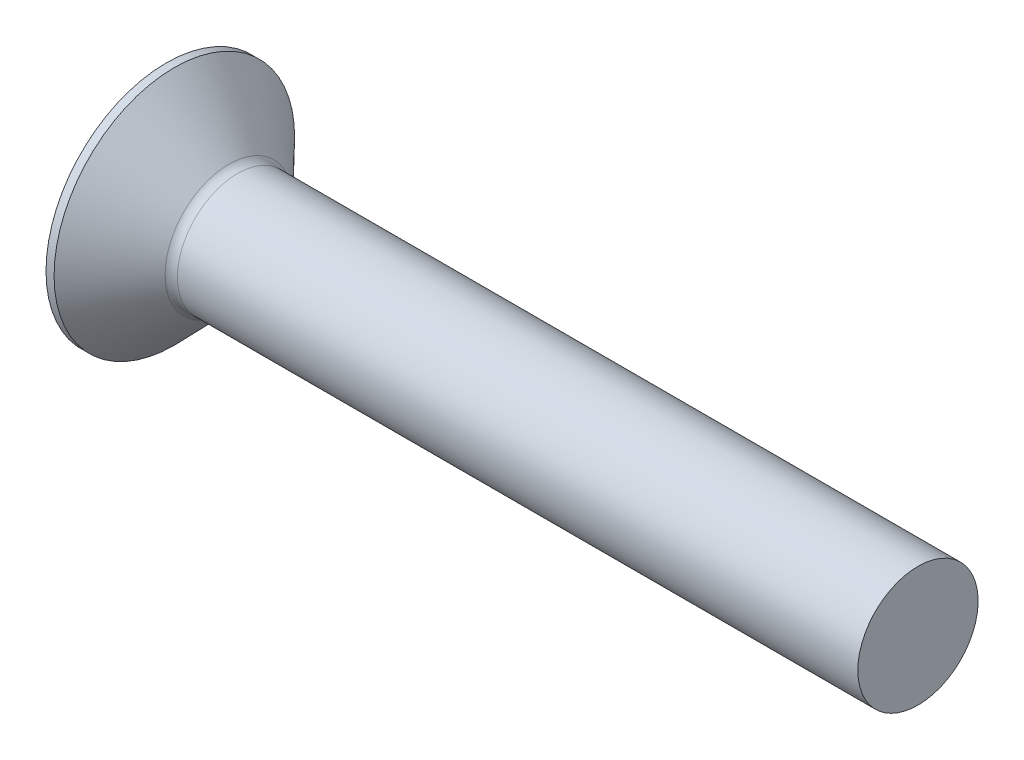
ISO-10303-21;
HEADER;
FILE_DESCRIPTION(('STEP AP214'),'2;1');
FILE_NAME('part.step','',(''),(''),'','','');
FILE_SCHEMA(('AUTOMOTIVE_DESIGN { 1 0 10303 214 1 1 1 1 }'));
ENDSEC;
DATA;
#1=APPLICATION_CONTEXT('core data for automotive mechanical design processes');
#2=APPLICATION_PROTOCOL_DEFINITION('international standard','automotive_design',2000,#1);
#3=PRODUCT_CONTEXT('',#1,'mechanical');
#4=PRODUCT('Part','Part','',(#3));
#5=PRODUCT_RELATED_PRODUCT_CATEGORY('part','',(#4));
#6=PRODUCT_DEFINITION_FORMATION('','',#4);
#7=PRODUCT_DEFINITION_CONTEXT('part definition',#1,'design');
#8=PRODUCT_DEFINITION('design','',#6,#7);
#9=PRODUCT_DEFINITION_SHAPE('','',#8);
#10=(LENGTH_UNIT() NAMED_UNIT(*) SI_UNIT(.MILLI.,.METRE.));
#11=(NAMED_UNIT(*) PLANE_ANGLE_UNIT() SI_UNIT($,.RADIAN.));
#12=(NAMED_UNIT(*) SI_UNIT($,.STERADIAN.) SOLID_ANGLE_UNIT());
#13=UNCERTAINTY_MEASURE_WITH_UNIT(LENGTH_MEASURE(1.E-05),#10,'distance_accuracy_value','');
#14=(GEOMETRIC_REPRESENTATION_CONTEXT(3) GLOBAL_UNCERTAINTY_ASSIGNED_CONTEXT((#13)) GLOBAL_UNIT_ASSIGNED_CONTEXT((#10,
#11,#12)) REPRESENTATION_CONTEXT('',''));
#15=CARTESIAN_POINT('',(0.,0.,0.));
#16=DIRECTION('',(0.,0.,1.));
#17=DIRECTION('',(1.,0.,0.));
#18=AXIS2_PLACEMENT_3D('',#15,#16,#17);
#19=CARTESIAN_POINT('',(0.,0.,0.));
#20=DIRECTION('',(1.,0.,0.));
#21=DIRECTION('',(0.,0.,-1.));
#22=AXIS2_PLACEMENT_3D('',#19,#20,#21);
#23=PLANE('',#22);
#24=CARTESIAN_POINT('',(0.,0.,0.));
#25=DIRECTION('',(-1.,0.,0.));
#26=DIRECTION('',(0.,0.,1.));
#27=AXIS2_PLACEMENT_3D('',#24,#25,#26);
#28=CIRCLE('',#27,8.);
#29=CARTESIAN_POINT('',(0.,0.,8.));
#30=VERTEX_POINT('',#29);
#31=EDGE_CURVE('E722',#30,#30,#28,.T.);
#32=ORIENTED_EDGE('',*,*,#31,.T.);
#33=EDGE_LOOP('',(#32));
#34=FACE_BOUND('',#33,.T.);
#35=CARTESIAN_POINT('',(0.,0.,0.));
#36=DIRECTION('',(-1.,0.,0.));
#37=DIRECTION('',(0.,0.,1.));
#38=AXIS2_PLACEMENT_3D('',#35,#36,#37);
#39=CIRCLE('',#38,2.0328);
#40=CARTESIAN_POINT('',(0.,-0.923999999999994,-1.81066281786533));
#41=VERTEX_POINT('',#40);
#42=CARTESIAN_POINT('',(0.,-1.81066281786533,-0.924000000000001));
#43=VERTEX_POINT('',#42);
#44=EDGE_CURVE('E624',#41,#43,#39,.T.);
#45=ORIENTED_EDGE('',*,*,#44,.F.);
#46=DIRECTION('',(0.,0.,1.));
#47=VECTOR('',#46,1.);
#48=CARTESIAN_POINT('',(0.,-0.924000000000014,4.2));
#49=LINE('',#48,#47);
#50=CARTESIAN_POINT('',(0.,-0.923999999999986,-4.2));
#51=VERTEX_POINT('',#50);
#52=EDGE_CURVE('E419',#51,#41,#49,.T.);
#53=ORIENTED_EDGE('',*,*,#52,.F.);
#54=DIRECTION('',(0.,-1.,0.));
#55=VECTOR('',#54,1.);
#56=CARTESIAN_POINT('',(0.,0.924000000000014,-4.2));
#57=LINE('',#56,#55);
#58=CARTESIAN_POINT('',(0.,0.924000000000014,-4.2));
#59=VERTEX_POINT('',#58);
#60=EDGE_CURVE('E225',#59,#51,#57,.T.);
#61=ORIENTED_EDGE('',*,*,#60,.F.);
#62=DIRECTION('',(0.,0.,-1.));
#63=VECTOR('',#62,1.);
#64=CARTESIAN_POINT('',(0.,0.923999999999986,4.2));
#65=LINE('',#64,#63);
#66=CARTESIAN_POINT('',(0.,0.924000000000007,-1.81066281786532));
#67=VERTEX_POINT('',#66);
#68=EDGE_CURVE('E429',#67,#59,#65,.T.);
#69=ORIENTED_EDGE('',*,*,#68,.F.);
#70=CARTESIAN_POINT('',(0.,1.81066281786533,-0.924000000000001));
#71=VERTEX_POINT('',#70);
#72=EDGE_CURVE('E622',#71,#67,#39,.T.);
#73=ORIENTED_EDGE('',*,*,#72,.F.);
#74=DIRECTION('',(0.,-1.,0.));
#75=VECTOR('',#74,1.);
#76=CARTESIAN_POINT('',(0.,4.2,-0.924));
#77=LINE('',#76,#75);
#78=CARTESIAN_POINT('',(0.,4.2,-0.924));
#79=VERTEX_POINT('',#78);
#80=EDGE_CURVE('E554',#79,#71,#77,.T.);
#81=ORIENTED_EDGE('',*,*,#80,.F.);
#82=DIRECTION('',(0.,0.,-1.));
#83=VECTOR('',#82,1.);
#84=CARTESIAN_POINT('',(0.,4.2,-0.924));
#85=LINE('',#84,#83);
#86=CARTESIAN_POINT('',(0.,4.2,0.924));
#87=VERTEX_POINT('',#86);
#88=EDGE_CURVE('E651',#87,#79,#85,.T.);
#89=ORIENTED_EDGE('',*,*,#88,.F.);
#90=DIRECTION('',(0.,1.,0.));
#91=VECTOR('',#90,1.);
#92=CARTESIAN_POINT('',(0.,4.2,0.924));
#93=LINE('',#92,#91);
#94=CARTESIAN_POINT('',(0.,1.81066281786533,0.924000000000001));
#95=VERTEX_POINT('',#94);
#96=EDGE_CURVE('E76',#95,#87,#93,.T.);
#97=ORIENTED_EDGE('',*,*,#96,.F.);
#98=CARTESIAN_POINT('',(0.,0.923999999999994,1.81066281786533));
#99=VERTEX_POINT('',#98);
#100=EDGE_CURVE('E619',#99,#95,#39,.T.);
#101=ORIENTED_EDGE('',*,*,#100,.F.);
#102=CARTESIAN_POINT('',(0.,0.923999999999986,4.2));
#103=VERTEX_POINT('',#102);
#104=EDGE_CURVE('E417',#103,#99,#65,.T.);
#105=ORIENTED_EDGE('',*,*,#104,.F.);
#106=DIRECTION('',(0.,1.,0.));
#107=VECTOR('',#106,1.);
#108=CARTESIAN_POINT('',(0.,0.923999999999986,4.2));
#109=LINE('',#108,#107);
#110=CARTESIAN_POINT('',(0.,-0.924000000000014,4.2));
#111=VERTEX_POINT('',#110);
#112=EDGE_CURVE('E349',#111,#103,#109,.T.);
#113=ORIENTED_EDGE('',*,*,#112,.F.);
#114=CARTESIAN_POINT('',(0.,-0.924000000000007,1.81066281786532));
#115=VERTEX_POINT('',#114);
#116=EDGE_CURVE('E416',#115,#111,#49,.T.);
#117=ORIENTED_EDGE('',*,*,#116,.F.);
#118=CARTESIAN_POINT('',(0.,-1.81066281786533,0.924000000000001));
#119=VERTEX_POINT('',#118);
#120=EDGE_CURVE('E597',#119,#115,#39,.T.);
#121=ORIENTED_EDGE('',*,*,#120,.F.);
#122=CARTESIAN_POINT('',(0.,-4.2,0.924000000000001));
#123=VERTEX_POINT('',#122);
#124=EDGE_CURVE('E635',#123,#119,#93,.T.);
#125=ORIENTED_EDGE('',*,*,#124,.F.);
#126=DIRECTION('',(0.,0.,1.));
#127=VECTOR('',#126,1.);
#128=CARTESIAN_POINT('',(0.,-4.2,-0.923999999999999));
#129=LINE('',#128,#127);
#130=CARTESIAN_POINT('',(0.,-4.2,-0.923999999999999));
#131=VERTEX_POINT('',#130);
#132=EDGE_CURVE('E547',#131,#123,#129,.T.);
#133=ORIENTED_EDGE('',*,*,#132,.F.);
#134=EDGE_CURVE('E551',#43,#131,#77,.T.);
#135=ORIENTED_EDGE('',*,*,#134,.F.);
#136=EDGE_LOOP('',(#45,#53,#61,#69,#73,#81,#89,#97,#101,#105,#113,#117,#121,#125,#133,#135));
#137=FACE_BOUND('',#136,.T.);
#138=ADVANCED_FACE('F50',(#34,#137),#23,.F.);
#139=CARTESIAN_POINT('',(4.96,-1.72703563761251,0.924));
#140=DIRECTION('',(0.,0.,-1.));
#141=DIRECTION('',(-1.,0.,0.));
#142=AXIS2_PLACEMENT_3D('',#139,#140,#141);
#143=PLANE('',#142);
#144=ORIENTED_EDGE('',*,*,#124,.T.);
#145=CARTESIAN_POINT('',(-0.000200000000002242,-1.81067851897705,0.924000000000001));
#146=CARTESIAN_POINT('',(0.631276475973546,-1.76108294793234,0.924000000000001));
#147=CARTESIAN_POINT('',(1.26272398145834,-1.71110880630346,0.924));
#148=CARTESIAN_POINT('',(2.52552970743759,-1.61006759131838,0.924));
#149=CARTESIAN_POINT('',(3.15688792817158,-1.55900052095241,0.924));
#150=CARTESIAN_POINT('',(3.98353507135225,-1.49119581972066,0.924));
#151=CARTESIAN_POINT('',(4.17887697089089,-1.47510427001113,0.924));
#152=CARTESIAN_POINT('',(4.56954826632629,-1.44276813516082,0.924));
#153=CARTESIAN_POINT('',(4.76487766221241,-1.4265235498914,0.924));
#154=CARTESIAN_POINT('',(4.9602,-1.41019435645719,0.924));
#155=B_SPLINE_CURVE_WITH_KNOTS('',3,(#145,#146,#147,#148,#149,#150,#151,#152,#153,#154),
.UNSPECIFIED.,.F.,.F.,(4,2,2,2,4),(0.,1.90026434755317,3.80052349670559,4.38853412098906,
4.97654523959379),.UNSPECIFIED.);
#156=CARTESIAN_POINT('',(4.96,-1.4102110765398,0.924000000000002));
#157=VERTEX_POINT('',#156);
#158=EDGE_CURVE('E325',#119,#157,#155,.T.);
#159=ORIENTED_EDGE('',*,*,#158,.T.);
#160=DIRECTION('',(0.,-1.,0.));
#161=VECTOR('',#160,1.);
#162=CARTESIAN_POINT('',(4.96,1.72703563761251,0.924));
#163=LINE('',#162,#161);
#164=CARTESIAN_POINT('',(4.96,-1.72703563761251,0.924));
#165=VERTEX_POINT('',#164);
#166=EDGE_CURVE('E527',#157,#165,#163,.T.);
#167=ORIENTED_EDGE('',*,*,#166,.T.);
#168=DIRECTION('',(0.894934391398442,0.446197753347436,0.));
#169=VECTOR('',#168,1.);
#170=CARTESIAN_POINT('',(0.,-4.2,0.924000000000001));
#171=LINE('',#170,#169);
#172=EDGE_CURVE('E545',#123,#165,#171,.T.);
#173=ORIENTED_EDGE('',*,*,#172,.F.);
#174=EDGE_LOOP('',(#144,#159,#167,#173));
#175=FACE_BOUND('',#174,.T.);
#176=ADVANCED_FACE('F182',(#175),#143,.T.);
#177=CARTESIAN_POINT('',(4.96,1.72703563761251,0.924));
#178=VERTEX_POINT('',#177);
#179=CARTESIAN_POINT('',(4.96,1.4102110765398,0.924000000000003));
#180=VERTEX_POINT('',#179);
#181=EDGE_CURVE('E524',#178,#180,#163,.T.);
#182=ORIENTED_EDGE('',*,*,#181,.T.);
#183=CARTESIAN_POINT('',(4.9602,1.41019435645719,0.924));
#184=CARTESIAN_POINT('',(4.43668564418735,1.45394526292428,0.924));
#185=CARTESIAN_POINT('',(3.9131235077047,1.49711945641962,0.924));
#186=CARTESIAN_POINT('',(2.86592338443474,1.58252659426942,0.924));
#187=CARTESIAN_POINT('',(2.34228539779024,1.62475954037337,0.924));
#188=CARTESIAN_POINT('',(1.51550012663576,1.69086309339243,0.924));
#189=CARTESIAN_POINT('',(1.21237215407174,1.71497604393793,0.924));
#190=CARTESIAN_POINT('',(0.606098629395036,1.76298409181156,0.924000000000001));
#191=CARTESIAN_POINT('',(0.302953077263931,1.78687918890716,0.924000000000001));
#192=CARTESIAN_POINT('',(-0.00020000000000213,1.81067851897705,0.924000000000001));
#193=B_SPLINE_CURVE_WITH_KNOTS('',3,(#183,#184,#185,#186,#187,#188,#189,#190,#191,#192),
.UNSPECIFIED.,.F.,.F.,(4,2,2,2,4),(0.,1.57601712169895,3.152031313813,4.06428781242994,
4.97654528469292),.UNSPECIFIED.);
#194=EDGE_CURVE('E324',#180,#95,#193,.T.);
#195=ORIENTED_EDGE('',*,*,#194,.T.);
#196=ORIENTED_EDGE('',*,*,#96,.T.);
#197=DIRECTION('',(0.894934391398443,-0.446197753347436,0.));
#198=VECTOR('',#197,1.);
#199=CARTESIAN_POINT('',(0.,4.2,0.924));
#200=LINE('',#199,#198);
#201=EDGE_CURVE('E585',#87,#178,#200,.T.);
#202=ORIENTED_EDGE('',*,*,#201,.T.);
#203=EDGE_LOOP('',(#182,#195,#196,#202));
#204=FACE_BOUND('',#203,.T.);
#205=ADVANCED_FACE('F187',(#204),#143,.T.);
#206=CARTESIAN_POINT('',(4.96,1.72703563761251,-0.924));
#207=DIRECTION('',(0.,0.,1.));
#208=DIRECTION('',(0.,-1.,0.));
#209=AXIS2_PLACEMENT_3D('',#206,#207,#208);
#210=PLANE('',#209);
#211=DIRECTION('',(0.,1.,0.));
#212=VECTOR('',#211,1.);
#213=CARTESIAN_POINT('',(4.96,1.72703563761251,-0.924));
#214=LINE('',#213,#212);
#215=CARTESIAN_POINT('',(4.96,-1.72703563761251,-0.924000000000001));
#216=VERTEX_POINT('',#215);
#217=CARTESIAN_POINT('',(4.96,-1.41021107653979,-0.924000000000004));
#218=VERTEX_POINT('',#217);
#219=EDGE_CURVE('E399',#216,#218,#214,.T.);
#220=ORIENTED_EDGE('',*,*,#219,.T.);
#221=CARTESIAN_POINT('',(4.9602,-1.41019435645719,-0.924000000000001));
#222=CARTESIAN_POINT('',(4.43668564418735,-1.45394526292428,-0.924000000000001));
#223=CARTESIAN_POINT('',(3.9131235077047,-1.49711945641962,-0.924000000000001));
#224=CARTESIAN_POINT('',(2.86592338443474,-1.58252659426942,-0.924000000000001));
#225=CARTESIAN_POINT('',(2.34228539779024,-1.62475954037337,-0.924000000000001));
#226=CARTESIAN_POINT('',(1.51550012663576,-1.69086309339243,-0.924000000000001));
#227=CARTESIAN_POINT('',(1.21237215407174,-1.71497604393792,-0.924000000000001));
#228=CARTESIAN_POINT('',(0.606098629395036,-1.76298409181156,-0.924000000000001));
#229=CARTESIAN_POINT('',(0.302953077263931,-1.78687918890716,-0.924000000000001));
#230=CARTESIAN_POINT('',(-0.00020000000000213,-1.81067851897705,-0.924000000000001));
#231=B_SPLINE_CURVE_WITH_KNOTS('',3,(#221,#222,#223,#224,#225,#226,#227,#228,#229,#230),
.UNSPECIFIED.,.F.,.F.,(4,2,2,2,4),(0.,1.57601712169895,3.152031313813,4.06428781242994,
4.97654528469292),.UNSPECIFIED.);
#232=EDGE_CURVE('E629',#218,#43,#231,.T.);
#233=ORIENTED_EDGE('',*,*,#232,.T.);
#234=ORIENTED_EDGE('',*,*,#134,.T.);
#235=DIRECTION('',(0.894934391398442,0.446197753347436,0.));
#236=VECTOR('',#235,1.);
#237=CARTESIAN_POINT('',(0.,-4.2,-0.923999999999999));
#238=LINE('',#237,#236);
#239=EDGE_CURVE('E552',#131,#216,#238,.T.);
#240=ORIENTED_EDGE('',*,*,#239,.T.);
#241=EDGE_LOOP('',(#220,#233,#234,#240));
#242=FACE_BOUND('',#241,.T.);
#243=ADVANCED_FACE('F330',(#242),#210,.T.);
#244=ORIENTED_EDGE('',*,*,#80,.T.);
#245=CARTESIAN_POINT('',(-0.000200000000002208,1.81067851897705,-0.924000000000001));
#246=CARTESIAN_POINT('',(0.631276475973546,1.76108294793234,-0.924000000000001));
#247=CARTESIAN_POINT('',(1.26272398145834,1.71110880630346,-0.924000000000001));
#248=CARTESIAN_POINT('',(2.52552970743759,1.61006759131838,-0.924000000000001));
#249=CARTESIAN_POINT('',(3.15688792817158,1.5590005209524,-0.924000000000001));
#250=CARTESIAN_POINT('',(3.98353507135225,1.49119581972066,-0.924000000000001));
#251=CARTESIAN_POINT('',(4.17887697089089,1.47510427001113,-0.924000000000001));
#252=CARTESIAN_POINT('',(4.56954826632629,1.44276813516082,-0.924000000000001));
#253=CARTESIAN_POINT('',(4.76487766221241,1.4265235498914,-0.924000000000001));
#254=CARTESIAN_POINT('',(4.9602,1.41019435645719,-0.924));
#255=B_SPLINE_CURVE_WITH_KNOTS('',3,(#245,#246,#247,#248,#249,#250,#251,#252,#253,#254),
.UNSPECIFIED.,.F.,.F.,(4,2,2,2,4),(0.,1.90026434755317,3.80052349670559,4.38853412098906,
4.97654523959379),.UNSPECIFIED.);
#256=CARTESIAN_POINT('',(4.96,1.4102110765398,-0.924000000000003));
#257=VERTEX_POINT('',#256);
#258=EDGE_CURVE('E634',#71,#257,#255,.T.);
#259=ORIENTED_EDGE('',*,*,#258,.T.);
#260=CARTESIAN_POINT('',(4.96,1.72703563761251,-0.924));
#261=VERTEX_POINT('',#260);
#262=EDGE_CURVE('E528',#257,#261,#214,.T.);
#263=ORIENTED_EDGE('',*,*,#262,.T.);
#264=DIRECTION('',(0.894934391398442,-0.446197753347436,0.));
#265=VECTOR('',#264,1.);
#266=CARTESIAN_POINT('',(0.,4.2,-0.924));
#267=LINE('',#266,#265);
#268=EDGE_CURVE('E555',#79,#261,#267,.T.);
#269=ORIENTED_EDGE('',*,*,#268,.F.);
#270=EDGE_LOOP('',(#244,#259,#263,#269));
#271=FACE_BOUND('',#270,.T.);
#272=ADVANCED_FACE('F455',(#271),#210,.T.);
#273=CARTESIAN_POINT('',(4.96,1.72703563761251,-0.924));
#274=DIRECTION('',(-1.,0.,0.));
#275=DIRECTION('',(0.,0.,1.));
#276=AXIS2_PLACEMENT_3D('',#273,#274,#275);
#277=PLANE('',#276);
#278=ORIENTED_EDGE('',*,*,#166,.F.);
#279=CARTESIAN_POINT('',(4.96,0.,0.));
#280=DIRECTION('',(-1.,0.,0.));
#281=DIRECTION('',(0.,0.,1.));
#282=AXIS2_PLACEMENT_3D('',#279,#280,#281);
#283=CIRCLE('',#282,1.68596301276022);
#284=EDGE_CURVE('E609',#218,#157,#283,.T.);
#285=ORIENTED_EDGE('',*,*,#284,.F.);
#286=ORIENTED_EDGE('',*,*,#219,.F.);
#287=DIRECTION('',(0.,0.,-1.));
#288=VECTOR('',#287,1.);
#289=CARTESIAN_POINT('',(4.96,-1.72703563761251,-0.924000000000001));
#290=LINE('',#289,#288);
#291=EDGE_CURVE('E533',#165,#216,#290,.T.);
#292=ORIENTED_EDGE('',*,*,#291,.F.);
#293=EDGE_LOOP('',(#278,#285,#286,#292));
#294=FACE_BOUND('',#293,.T.);
#295=ADVANCED_FACE('F445',(#294),#277,.T.);
#296=DIRECTION('',(0.,0.,-1.));
#297=VECTOR('',#296,1.);
#298=CARTESIAN_POINT('',(4.96,-0.924000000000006,1.72703563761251));
#299=LINE('',#298,#297);
#300=CARTESIAN_POINT('',(4.96,-0.923999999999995,-1.4102110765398));
#301=VERTEX_POINT('',#300);
#302=CARTESIAN_POINT('',(4.96,-0.923999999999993,-1.72703563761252));
#303=VERTEX_POINT('',#302);
#304=EDGE_CURVE('E386',#301,#303,#299,.T.);
#305=ORIENTED_EDGE('',*,*,#304,.F.);
#306=CARTESIAN_POINT('',(4.96,0.924000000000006,-1.41021107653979));
#307=VERTEX_POINT('',#306);
#308=EDGE_CURVE('E599',#307,#301,#283,.T.);
#309=ORIENTED_EDGE('',*,*,#308,.F.);
#310=DIRECTION('',(0.,0.,1.));
#311=VECTOR('',#310,1.);
#312=CARTESIAN_POINT('',(4.96,0.923999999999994,1.72703563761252));
#313=LINE('',#312,#311);
#314=CARTESIAN_POINT('',(4.96,0.924000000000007,-1.72703563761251));
#315=VERTEX_POINT('',#314);
#316=EDGE_CURVE('E393',#315,#307,#313,.T.);
#317=ORIENTED_EDGE('',*,*,#316,.F.);
#318=DIRECTION('',(0.,1.,0.));
#319=VECTOR('',#318,1.);
#320=CARTESIAN_POINT('',(4.96,0.924000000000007,-1.72703563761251));
#321=LINE('',#320,#319);
#322=EDGE_CURVE('E388',#303,#315,#321,.T.);
#323=ORIENTED_EDGE('',*,*,#322,.F.);
#324=EDGE_LOOP('',(#305,#309,#317,#323));
#325=FACE_BOUND('',#324,.T.);
#326=ADVANCED_FACE('F454',(#325),#277,.T.);
#327=ORIENTED_EDGE('',*,*,#262,.F.);
#328=EDGE_CURVE('E591',#180,#257,#283,.T.);
#329=ORIENTED_EDGE('',*,*,#328,.F.);
#330=ORIENTED_EDGE('',*,*,#181,.F.);
#331=DIRECTION('',(0.,0.,1.));
#332=VECTOR('',#331,1.);
#333=CARTESIAN_POINT('',(4.96,1.72703563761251,-0.924));
#334=LINE('',#333,#332);
#335=EDGE_CURVE('E526',#261,#178,#334,.T.);
#336=ORIENTED_EDGE('',*,*,#335,.F.);
#337=EDGE_LOOP('',(#327,#329,#330,#336));
#338=FACE_BOUND('',#337,.T.);
#339=ADVANCED_FACE('F589',(#338),#277,.T.);
#340=CARTESIAN_POINT('',(4.96,0.923999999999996,1.41021107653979));
#341=VERTEX_POINT('',#340);
#342=CARTESIAN_POINT('',(4.96,0.923999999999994,1.72703563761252));
#343=VERTEX_POINT('',#342);
#344=EDGE_CURVE('E514',#341,#343,#313,.T.);
#345=ORIENTED_EDGE('',*,*,#344,.F.);
#346=CARTESIAN_POINT('',(4.96,-0.924000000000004,1.41021107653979));
#347=VERTEX_POINT('',#346);
#348=EDGE_CURVE('E515',#347,#341,#283,.T.);
#349=ORIENTED_EDGE('',*,*,#348,.F.);
#350=CARTESIAN_POINT('',(4.96,-0.924000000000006,1.72703563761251));
#351=VERTEX_POINT('',#350);
#352=EDGE_CURVE('E54',#351,#347,#299,.T.);
#353=ORIENTED_EDGE('',*,*,#352,.F.);
#354=DIRECTION('',(0.,-1.,0.));
#355=VECTOR('',#354,1.);
#356=CARTESIAN_POINT('',(4.96,0.923999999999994,1.72703563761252));
#357=LINE('',#356,#355);
#358=EDGE_CURVE('E385',#343,#351,#357,.T.);
#359=ORIENTED_EDGE('',*,*,#358,.F.);
#360=EDGE_LOOP('',(#345,#349,#353,#359));
#361=FACE_BOUND('',#360,.T.);
#362=ADVANCED_FACE('F253',(#361),#277,.T.);
#363=CARTESIAN_POINT('',(4.96,-0.923999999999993,-1.72703563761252));
#364=DIRECTION('',(0.,1.,0.));
#365=DIRECTION('',(-1.,0.,0.));
#366=AXIS2_PLACEMENT_3D('',#363,#364,#365);
#367=PLANE('',#366);
#368=ORIENTED_EDGE('',*,*,#52,.T.);
#369=CARTESIAN_POINT('',(-0.000200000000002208,-0.923999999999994,-1.81067851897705));
#370=CARTESIAN_POINT('',(0.631276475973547,-0.923999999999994,-1.76108294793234));
#371=CARTESIAN_POINT('',(1.26272398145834,-0.923999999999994,-1.71110880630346));
#372=CARTESIAN_POINT('',(2.52552970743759,-0.923999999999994,-1.61006759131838));
#373=CARTESIAN_POINT('',(3.15688792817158,-0.923999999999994,-1.55900052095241));
#374=CARTESIAN_POINT('',(3.98353507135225,-0.923999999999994,-1.49119581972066));
#375=CARTESIAN_POINT('',(4.17887697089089,-0.923999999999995,-1.47510427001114));
#376=CARTESIAN_POINT('',(4.56954826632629,-0.923999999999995,-1.44276813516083));
#377=CARTESIAN_POINT('',(4.76487766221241,-0.923999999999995,-1.4265235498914));
#378=CARTESIAN_POINT('',(4.9602,-0.923999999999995,-1.41019435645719));
#379=B_SPLINE_CURVE_WITH_KNOTS('',3,(#369,#370,#371,#372,#373,#374,#375,#376,#377,#378),
.UNSPECIFIED.,.F.,.F.,(4,2,2,2,4),(0.,1.90026434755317,3.80052349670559,4.38853412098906,
4.97654523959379),.UNSPECIFIED.);
#380=EDGE_CURVE('E630',#41,#301,#379,.T.);
#381=ORIENTED_EDGE('',*,*,#380,.T.);
#382=ORIENTED_EDGE('',*,*,#304,.T.);
#383=DIRECTION('',(0.894934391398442,0.,0.446197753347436));
#384=VECTOR('',#383,1.);
#385=CARTESIAN_POINT('',(0.,-0.923999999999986,-4.2));
#386=LINE('',#385,#384);
#387=EDGE_CURVE('E430',#51,#303,#386,.T.);
#388=ORIENTED_EDGE('',*,*,#387,.F.);
#389=EDGE_LOOP('',(#368,#381,#382,#388));
#390=FACE_BOUND('',#389,.T.);
#391=ADVANCED_FACE('F243',(#390),#367,.T.);
#392=CARTESIAN_POINT('',(4.96,0.923999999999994,1.72703563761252));
#393=DIRECTION('',(0.,-1.,0.));
#394=DIRECTION('',(0.,0.,-1.));
#395=AXIS2_PLACEMENT_3D('',#392,#393,#394);
#396=PLANE('',#395);
#397=ORIENTED_EDGE('',*,*,#316,.T.);
#398=CARTESIAN_POINT('',(4.9602,0.924000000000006,-1.41019435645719));
#399=CARTESIAN_POINT('',(4.43668564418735,0.924000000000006,-1.45394526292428));
#400=CARTESIAN_POINT('',(3.9131235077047,0.924000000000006,-1.49711945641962));
#401=CARTESIAN_POINT('',(2.86592338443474,0.924000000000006,-1.58252659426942));
#402=CARTESIAN_POINT('',(2.34228539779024,0.924000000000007,-1.62475954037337));
#403=CARTESIAN_POINT('',(1.51550012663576,0.924000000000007,-1.69086309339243));
#404=CARTESIAN_POINT('',(1.21237215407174,0.924000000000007,-1.71497604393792));
#405=CARTESIAN_POINT('',(0.606098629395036,0.924000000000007,-1.76298409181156));
#406=CARTESIAN_POINT('',(0.302953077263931,0.924000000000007,-1.78687918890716));
#407=CARTESIAN_POINT('',(-0.000200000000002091,0.924000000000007,-1.81067851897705));
#408=B_SPLINE_CURVE_WITH_KNOTS('',3,(#398,#399,#400,#401,#402,#403,#404,#405,#406,#407),
.UNSPECIFIED.,.F.,.F.,(4,2,2,2,4),(0.,1.57601712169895,3.152031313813,4.06428781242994,
4.97654528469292),.UNSPECIFIED.);
#409=EDGE_CURVE('E278',#307,#67,#408,.T.);
#410=ORIENTED_EDGE('',*,*,#409,.T.);
#411=ORIENTED_EDGE('',*,*,#68,.T.);
#412=DIRECTION('',(0.894934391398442,0.,0.446197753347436));
#413=VECTOR('',#412,1.);
#414=CARTESIAN_POINT('',(0.,0.924000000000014,-4.2));
#415=LINE('',#414,#413);
#416=EDGE_CURVE('E660',#59,#315,#415,.T.);
#417=ORIENTED_EDGE('',*,*,#416,.T.);
#418=EDGE_LOOP('',(#397,#410,#411,#417));
#419=FACE_BOUND('',#418,.T.);
#420=ADVANCED_FACE('F252',(#419),#396,.T.);
#421=ORIENTED_EDGE('',*,*,#352,.T.);
#422=CARTESIAN_POINT('',(4.9602,-0.924000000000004,1.41019435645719));
#423=CARTESIAN_POINT('',(4.43668564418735,-0.924000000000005,1.45394526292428));
#424=CARTESIAN_POINT('',(3.9131235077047,-0.924000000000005,1.49711945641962));
#425=CARTESIAN_POINT('',(2.86592338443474,-0.924000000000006,1.58252659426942));
#426=CARTESIAN_POINT('',(2.34228539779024,-0.924000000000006,1.62475954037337));
#427=CARTESIAN_POINT('',(1.51550012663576,-0.924000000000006,1.69086309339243));
#428=CARTESIAN_POINT('',(1.21237215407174,-0.924000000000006,1.71497604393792));
#429=CARTESIAN_POINT('',(0.606098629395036,-0.924000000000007,1.76298409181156));
#430=CARTESIAN_POINT('',(0.302953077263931,-0.924000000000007,1.78687918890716));
#431=CARTESIAN_POINT('',(-0.000200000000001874,-0.924000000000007,1.81067851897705));
#432=B_SPLINE_CURVE_WITH_KNOTS('',3,(#422,#423,#424,#425,#426,#427,#428,#429,#430,#431),
.UNSPECIFIED.,.F.,.F.,(4,2,2,2,4),(0.,1.57601712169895,3.152031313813,4.06428781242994,
4.97654528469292),.UNSPECIFIED.);
#433=EDGE_CURVE('E276',#347,#115,#432,.T.);
#434=ORIENTED_EDGE('',*,*,#433,.T.);
#435=ORIENTED_EDGE('',*,*,#116,.T.);
#436=DIRECTION('',(0.894934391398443,0.,-0.446197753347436));
#437=VECTOR('',#436,1.);
#438=CARTESIAN_POINT('',(0.,-0.924000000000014,4.2));
#439=LINE('',#438,#437);
#440=EDGE_CURVE('E354',#111,#351,#439,.T.);
#441=ORIENTED_EDGE('',*,*,#440,.T.);
#442=EDGE_LOOP('',(#421,#434,#435,#441));
#443=FACE_BOUND('',#442,.T.);
#444=ADVANCED_FACE('F255',(#443),#367,.T.);
#445=ORIENTED_EDGE('',*,*,#104,.T.);
#446=CARTESIAN_POINT('',(-0.000200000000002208,0.923999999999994,1.81067851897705));
#447=CARTESIAN_POINT('',(0.631276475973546,0.923999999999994,1.76108294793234));
#448=CARTESIAN_POINT('',(1.26272398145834,0.923999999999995,1.71110880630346));
#449=CARTESIAN_POINT('',(2.52552970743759,0.923999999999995,1.61006759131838));
#450=CARTESIAN_POINT('',(3.15688792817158,0.923999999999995,1.55900052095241));
#451=CARTESIAN_POINT('',(3.98353507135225,0.923999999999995,1.49119581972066));
#452=CARTESIAN_POINT('',(4.17887697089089,0.923999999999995,1.47510427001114));
#453=CARTESIAN_POINT('',(4.56954826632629,0.923999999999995,1.44276813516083));
#454=CARTESIAN_POINT('',(4.76487766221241,0.923999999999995,1.4265235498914));
#455=CARTESIAN_POINT('',(4.9602,0.923999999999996,1.41019435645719));
#456=B_SPLINE_CURVE_WITH_KNOTS('',3,(#446,#447,#448,#449,#450,#451,#452,#453,#454,#455),
.UNSPECIFIED.,.F.,.F.,(4,2,2,2,4),(0.,1.90026434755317,3.80052349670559,4.38853412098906,
4.97654523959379),.UNSPECIFIED.);
#457=EDGE_CURVE('E12',#99,#341,#456,.T.);
#458=ORIENTED_EDGE('',*,*,#457,.T.);
#459=ORIENTED_EDGE('',*,*,#344,.T.);
#460=DIRECTION('',(0.894934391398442,0.,-0.446197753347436));
#461=VECTOR('',#460,1.);
#462=CARTESIAN_POINT('',(0.,0.923999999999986,4.2));
#463=LINE('',#462,#461);
#464=EDGE_CURVE('E659',#103,#343,#463,.T.);
#465=ORIENTED_EDGE('',*,*,#464,.F.);
#466=EDGE_LOOP('',(#445,#458,#459,#465));
#467=FACE_BOUND('',#466,.T.);
#468=ADVANCED_FACE('F615',(#467),#396,.T.);
#469=CARTESIAN_POINT('',(0.,0.,0.));
#470=DIRECTION('',(-1.,0.,0.));
#471=DIRECTION('',(0.,0.,1.));
#472=AXIS2_PLACEMENT_3D('',#469,#470,#471);
#473=CYLINDRICAL_SURFACE('',#472,8.);
#474=ORIENTED_EDGE('',*,*,#31,.F.);
#475=EDGE_LOOP('',(#474));
#476=FACE_BOUND('',#475,.T.);
#477=CARTESIAN_POINT('',(0.537244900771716,0.,0.));
#478=DIRECTION('',(-1.,0.,0.));
#479=DIRECTION('',(0.,0.,1.));
#480=AXIS2_PLACEMENT_3D('',#477,#478,#479);
#481=CIRCLE('',#480,8.);
#482=CARTESIAN_POINT('',(0.537244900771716,0.,8.));
#483=VERTEX_POINT('',#482);
#484=EDGE_CURVE('E658',#483,#483,#481,.T.);
#485=ORIENTED_EDGE('',*,*,#484,.T.);
#486=EDGE_LOOP('',(#485));
#487=FACE_BOUND('',#486,.T.);
#488=ADVANCED_FACE('F194',(#476,#487),#473,.T.);
#489=CARTESIAN_POINT('',(4.4,0.,0.));
#490=DIRECTION('',(-1.,0.,0.));
#491=DIRECTION('',(0.,0.,1.));
#492=AXIS2_PLACEMENT_3D('',#489,#490,#491);
#493=CONICAL_SURFACE('',#492,4.,0.802851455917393);
#494=CARTESIAN_POINT('',(4.16410801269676,0.,0.));
#495=DIRECTION('',(-1.,0.,0.));
#496=DIRECTION('',(0.,0.,1.));
#497=AXIS2_PLACEMENT_3D('',#494,#495,#496);
#498=CIRCLE('',#497,4.2442733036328);
#499=CARTESIAN_POINT('',(4.16410801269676,0.,4.2442733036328));
#500=VERTEX_POINT('',#499);
#501=EDGE_CURVE('E720',#500,#500,#498,.T.);
#502=ORIENTED_EDGE('',*,*,#501,.T.);
#503=EDGE_LOOP('',(#502));
#504=FACE_BOUND('',#503,.T.);
#505=ORIENTED_EDGE('',*,*,#484,.F.);
#506=EDGE_LOOP('',(#505));
#507=FACE_BOUND('',#506,.T.);
#508=ADVANCED_FACE('F731',(#504,#507),#493,.T.);
#509=CARTESIAN_POINT('',(0.,0.,0.));
#510=DIRECTION('',(-1.,0.,0.));
#511=DIRECTION('',(0.,0.,1.));
#512=AXIS2_PLACEMENT_3D('',#509,#510,#511);
#513=CYLINDRICAL_SURFACE('',#512,4.);
#514=CARTESIAN_POINT('',(4.73957985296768,0.,0.));
#515=DIRECTION('',(-1.,0.,0.));
#516=DIRECTION('',(0.,0.,1.));
#517=AXIS2_PLACEMENT_3D('',#514,#515,#516);
#518=CIRCLE('',#517,4.);
#519=CARTESIAN_POINT('',(4.73957985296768,0.,4.));
#520=VERTEX_POINT('',#519);
#521=EDGE_CURVE('E60',#520,#520,#518,.F.);
#522=ORIENTED_EDGE('',*,*,#521,.T.);
#523=EDGE_LOOP('',(#522));
#524=FACE_BOUND('',#523,.T.);
#525=CARTESIAN_POINT('',(50.,0.,0.));
#526=DIRECTION('',(-1.,0.,0.));
#527=DIRECTION('',(0.,0.,1.));
#528=AXIS2_PLACEMENT_3D('',#525,#526,#527);
#529=CIRCLE('',#528,4.);
#530=CARTESIAN_POINT('',(50.,0.,4.));
#531=VERTEX_POINT('',#530);
#532=EDGE_CURVE('E652',#531,#531,#529,.T.);
#533=ORIENTED_EDGE('',*,*,#532,.T.);
#534=EDGE_LOOP('',(#533));
#535=FACE_BOUND('',#534,.T.);
#536=ADVANCED_FACE('F713',(#524,#535),#513,.T.);
#537=CARTESIAN_POINT('',(50.,4.,0.));
#538=DIRECTION('',(-1.,0.,0.));
#539=DIRECTION('',(0.,0.,1.));
#540=AXIS2_PLACEMENT_3D('',#537,#538,#539);
#541=PLANE('',#540);
#542=ORIENTED_EDGE('',*,*,#532,.F.);
#543=EDGE_LOOP('',(#542));
#544=FACE_BOUND('',#543,.T.);
#545=ADVANCED_FACE('F459',(#544),#541,.F.);
#546=CARTESIAN_POINT('',(4.73957985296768,0.,0.));
#547=DIRECTION('',(-1.,0.,0.));
#548=DIRECTION('',(0.,0.,1.));
#549=AXIS2_PLACEMENT_3D('',#546,#547,#548);
#550=TOROIDAL_SURFACE('',#549,4.8,0.8);
#551=ORIENTED_EDGE('',*,*,#521,.F.);
#552=EDGE_LOOP('',(#551));
#553=FACE_BOUND('',#552,.T.);
#554=ORIENTED_EDGE('',*,*,#501,.F.);
#555=EDGE_LOOP('',(#554));
#556=FACE_BOUND('',#555,.T.);
#557=ADVANCED_FACE('F52',(#553,#556),#550,.F.);
#558=CARTESIAN_POINT('',(4.96,-1.72703563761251,-0.924000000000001));
#559=DIRECTION('',(-0.446197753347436,0.894934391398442,0.));
#560=DIRECTION('',(-0.894934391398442,-0.446197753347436,0.));
#561=AXIS2_PLACEMENT_3D('',#558,#559,#560);
#562=PLANE('',#561);
#563=ORIENTED_EDGE('',*,*,#239,.F.);
#564=ORIENTED_EDGE('',*,*,#132,.T.);
#565=ORIENTED_EDGE('',*,*,#172,.T.);
#566=ORIENTED_EDGE('',*,*,#291,.T.);
#567=EDGE_LOOP('',(#563,#564,#565,#566));
#568=FACE_BOUND('',#567,.T.);
#569=ADVANCED_FACE('F328',(#568),#562,.T.);
#570=CARTESIAN_POINT('',(4.96,1.72703563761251,0.923999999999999));
#571=DIRECTION('',(-0.446197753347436,-0.894934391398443,0.));
#572=DIRECTION('',(0.894934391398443,-0.446197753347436,0.));
#573=AXIS2_PLACEMENT_3D('',#570,#571,#572);
#574=PLANE('',#573);
#575=ORIENTED_EDGE('',*,*,#201,.F.);
#576=ORIENTED_EDGE('',*,*,#88,.T.);
#577=ORIENTED_EDGE('',*,*,#268,.T.);
#578=ORIENTED_EDGE('',*,*,#335,.T.);
#579=EDGE_LOOP('',(#575,#576,#577,#578));
#580=FACE_BOUND('',#579,.T.);
#581=ADVANCED_FACE('F457',(#580),#574,.T.);
#582=CARTESIAN_POINT('',(4.96,0.924000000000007,-1.72703563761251));
#583=DIRECTION('',(-0.446197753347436,0.,0.894934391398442));
#584=DIRECTION('',(-0.894934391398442,0.,-0.446197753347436));
#585=AXIS2_PLACEMENT_3D('',#582,#583,#584);
#586=PLANE('',#585);
#587=ORIENTED_EDGE('',*,*,#416,.F.);
#588=ORIENTED_EDGE('',*,*,#60,.T.);
#589=ORIENTED_EDGE('',*,*,#387,.T.);
#590=ORIENTED_EDGE('',*,*,#322,.T.);
#591=EDGE_LOOP('',(#587,#588,#589,#590));
#592=FACE_BOUND('',#591,.T.);
#593=ADVANCED_FACE('F256',(#592),#586,.T.);
#594=CARTESIAN_POINT('',(4.96,-0.924000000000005,1.72703563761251));
#595=DIRECTION('',(-0.446197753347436,0.,-0.894934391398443));
#596=DIRECTION('',(0.894934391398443,0.,-0.446197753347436));
#597=AXIS2_PLACEMENT_3D('',#594,#595,#596);
#598=PLANE('',#597);
#599=ORIENTED_EDGE('',*,*,#440,.F.);
#600=ORIENTED_EDGE('',*,*,#112,.T.);
#601=ORIENTED_EDGE('',*,*,#464,.T.);
#602=ORIENTED_EDGE('',*,*,#358,.T.);
#603=EDGE_LOOP('',(#599,#600,#601,#602));
#604=FACE_BOUND('',#603,.T.);
#605=ADVANCED_FACE('F356',(#604),#598,.T.);
#606=CARTESIAN_POINT('',(4.96,0.,0.));
#607=DIRECTION('',(-1.,0.,0.));
#608=DIRECTION('',(0.,0.,1.));
#609=AXIS2_PLACEMENT_3D('',#606,#607,#608);
#610=CONICAL_SURFACE('',#609,1.68596301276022,0.0698131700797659);
#611=ORIENTED_EDGE('',*,*,#120,.T.);
#612=ORIENTED_EDGE('',*,*,#433,.F.);
#613=EDGE_CURVE('E612',#157,#347,#283,.T.);
#614=ORIENTED_EDGE('',*,*,#613,.F.);
#615=ORIENTED_EDGE('',*,*,#158,.F.);
#616=EDGE_LOOP('',(#611,#612,#614,#615));
#617=FACE_BOUND('',#616,.T.);
#618=ADVANCED_FACE('F180',(#617),#610,.F.);
#619=EDGE_CURVE('E68',#341,#180,#283,.T.);
#620=ORIENTED_EDGE('',*,*,#619,.F.);
#621=ORIENTED_EDGE('',*,*,#457,.F.);
#622=ORIENTED_EDGE('',*,*,#100,.T.);
#623=ORIENTED_EDGE('',*,*,#194,.F.);
#624=EDGE_LOOP('',(#620,#621,#622,#623));
#625=FACE_BOUND('',#624,.T.);
#626=ADVANCED_FACE('F618',(#625),#610,.F.);
#627=EDGE_CURVE('E606',#301,#218,#283,.T.);
#628=ORIENTED_EDGE('',*,*,#627,.F.);
#629=ORIENTED_EDGE('',*,*,#380,.F.);
#630=ORIENTED_EDGE('',*,*,#44,.T.);
#631=ORIENTED_EDGE('',*,*,#232,.F.);
#632=EDGE_LOOP('',(#628,#629,#630,#631));
#633=FACE_BOUND('',#632,.T.);
#634=ADVANCED_FACE('F177',(#633),#610,.F.);
#635=ORIENTED_EDGE('',*,*,#72,.T.);
#636=ORIENTED_EDGE('',*,*,#409,.F.);
#637=EDGE_CURVE('E595',#257,#307,#283,.T.);
#638=ORIENTED_EDGE('',*,*,#637,.F.);
#639=ORIENTED_EDGE('',*,*,#258,.F.);
#640=EDGE_LOOP('',(#635,#636,#638,#639));
#641=FACE_BOUND('',#640,.T.);
#642=ADVANCED_FACE('F171',(#641),#610,.F.);
#643=CARTESIAN_POINT('',(5.50780258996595,0.,0.));
#644=DIRECTION('',(-1.,0.,0.));
#645=DIRECTION('',(0.,0.,1.));
#646=AXIS2_PLACEMENT_3D('',#643,#644,#645);
#647=CONICAL_SURFACE('',#646,0.,1.25663706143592);
#648=ORIENTED_EDGE('',*,*,#619,.T.);
#649=ORIENTED_EDGE('',*,*,#328,.T.);
#650=ORIENTED_EDGE('',*,*,#637,.T.);
#651=ORIENTED_EDGE('',*,*,#308,.T.);
#652=ORIENTED_EDGE('',*,*,#627,.T.);
#653=ORIENTED_EDGE('',*,*,#284,.T.);
#654=ORIENTED_EDGE('',*,*,#613,.T.);
#655=ORIENTED_EDGE('',*,*,#348,.T.);
#656=EDGE_LOOP('',(#648,#649,#650,#651,#652,#653,#654,#655));
#657=FACE_BOUND('',#656,.T.);
#658=CARTESIAN_POINT('',(5.50780258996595,0.,0.));
#659=VERTEX_POINT('',#658);
#660=VERTEX_LOOP('',#659);
#661=FACE_BOUND('',#660,.T.);
#662=ADVANCED_FACE('F169',(#657,#661),#647,.F.);
#663=CLOSED_SHELL('',(#138,#176,#205,#243,#272,#295,#326,#339,#362,#391,#420,#444,#468,#488,
#508,#536,#545,#557,#569,#581,#593,#605,#618,#626,#634,#642,#662));
#664=MANIFOLD_SOLID_BREP('B2',#663);
#665=ADVANCED_BREP_SHAPE_REPRESENTATION('',(#18,#664),#14);
#666=SHAPE_DEFINITION_REPRESENTATION(#9,#665);
ENDSEC;
END-ISO-10303-21;
